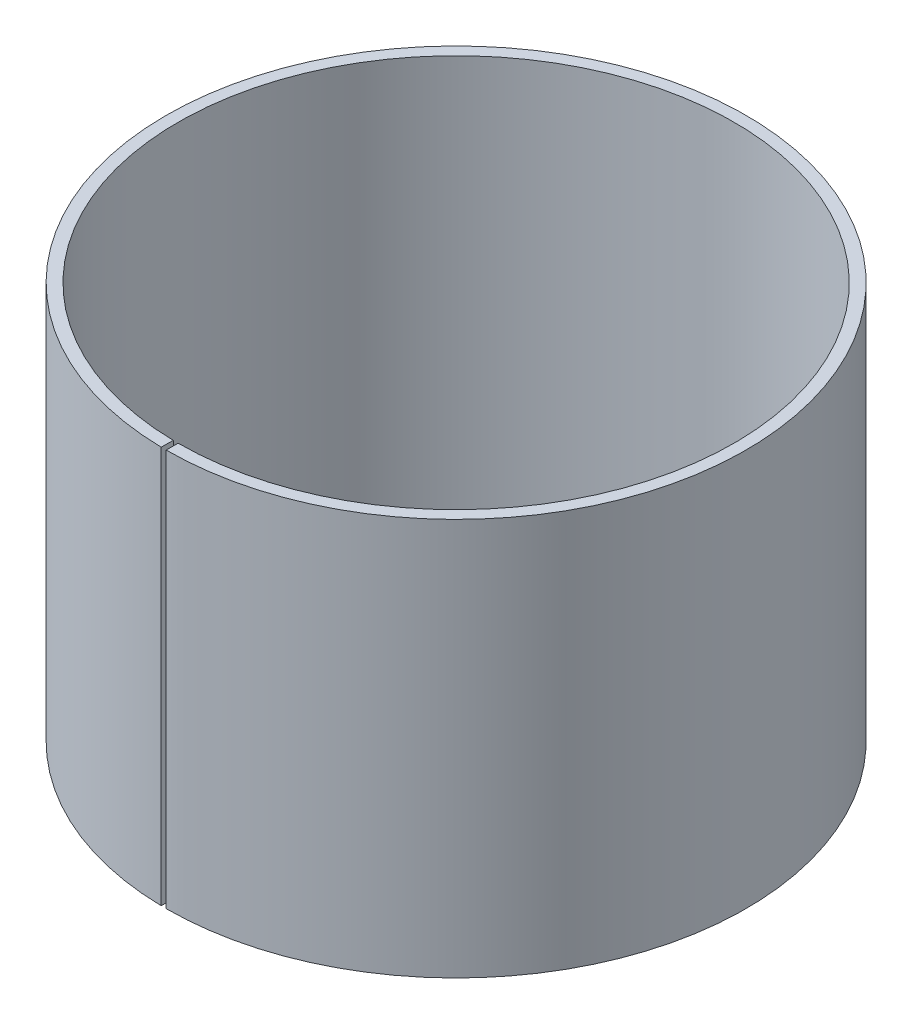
from build123d import *

# Parameters (mm, degrees)
EXTRUDE_THIN1_DEPTH = 50


with BuildPart() as part:
    # Sketch1 → Extrude-Thin1 (new body)
    with BuildSketch(Plane(origin=(0, 0, 0), x_dir=(1, 0, 0), z_dir=(0, 1, 0))):
        with BuildLine():
            ThreePointArc((0, -36.5), (0.318518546, 36.498610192), (-0.637012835, -36.494440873))
            Line((-0.637012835, -36.494440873), (-0.610834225, -34.99466933))
            ThreePointArc((-0.610834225, -34.99466933), (0.305428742, 34.998667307), (0, -35))
            Line((0, -35), (0, -36.5))
        make_face()
    extrude(amount=EXTRUDE_THIN1_DEPTH)


solid = part.part
